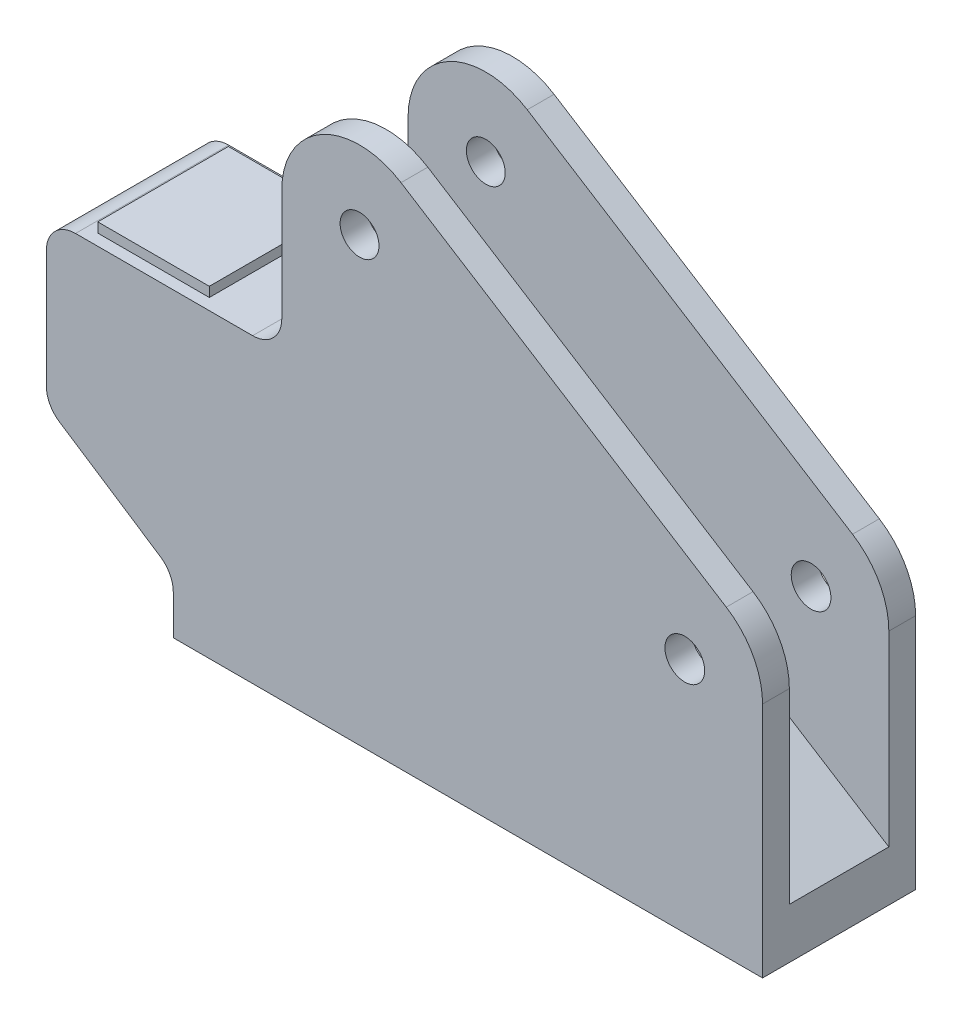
from build123d import *

# Parameters (mm, degrees)
SKETCH1_R           = 50.8
SKETCH1_R_2         = 51.902015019
BOSS_EXTRUDE1_DEPTH = 400
SKETCH2_W           = 2350.963372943
SKETCH2_H           = 260
CUT_EXTRUDE1_DEPTH  = 508
SKETCH3_W           = 291.494382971
SKETCH3_H           = 341.252466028
BOSS_EXTRUDE2_DEPTH = 25.4


with BuildPart() as part:
    # Sketch1 → Boss-Extrude1 (new body)
    with BuildSketch(Plane.XY):
        with BuildLine():
            Line((0, 0), (1540, 0))
            Line((1540, 0), (1540, 620))
            ThreePointArc((1540, 620), (1514.712023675, 718.171033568), (1445.14220638, 791.907551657))
            Line((1445.14220638, 791.907551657), (595.14220638, 1327.607551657))
            ThreePointArc((595.14220638, 1327.607551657), (388.628966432, 1333.612023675), (283.6, 1155.7))
            Line((283.6, 1155.7), (283.6, 863.6))
            ThreePointArc((283.6, 863.6), (261.281536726, 809.718463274), (207.4, 787.4))
            Line((207.4, 787.4), (-255.383480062, 787.4))
            ThreePointArc((-255.383480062, 787.4), (-309.265016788, 765.081536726), (-331.583480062, 711.2))
            Line((-331.583480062, 711.2), (-331.583480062, 403.289464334))
            ThreePointArc((-331.583480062, 403.289464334), (-322.426082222, 367.071658), (-297.154884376, 339.558861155))
            Line((-297.154884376, 339.558861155), (-34.428595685, 167.358293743))
            ThreePointArc((-34.428595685, 167.358293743), (-9.15739784, 139.845496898), (0, 103.627690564))
            Line((0, 103.627690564), (0, 0))
        make_face()
        with Locations((486.8, 1155.7)):
            Circle(SKETCH1_R, mode=Mode.SUBTRACT)
        with Locations((1336.8, 620)):
            Circle(SKETCH1_R_2, mode=Mode.SUBTRACT)
    extrude(amount=BOSS_EXTRUDE1_DEPTH)

    # Sketch2 → Cut-Extrude1 (cut)
    with BuildSketch(Plane(origin=(768.033367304, 1218.645440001, 0), x_dir=(0.8460017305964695, -0.5331801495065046, 0), z_dir=(0.5331801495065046, 0.8460017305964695, 0))):
        with Locations((532.734766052, -200)):
            Rectangle(SKETCH2_W, SKETCH2_H)
    extrude(amount=-CUT_EXTRUDE1_DEPTH, mode=Mode.SUBTRACT)

    # Sketch3 → Boss-Extrude2 (add)
    with BuildSketch(Plane(origin=(0, 787.4, 0), x_dir=(1, 0, 0), z_dir=(0, 1, 0))):
        with Locations((-81.339186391, -199.538011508)):
            Rectangle(SKETCH3_W, SKETCH3_H)
    extrude(amount=BOSS_EXTRUDE2_DEPTH)


solid = part.part
